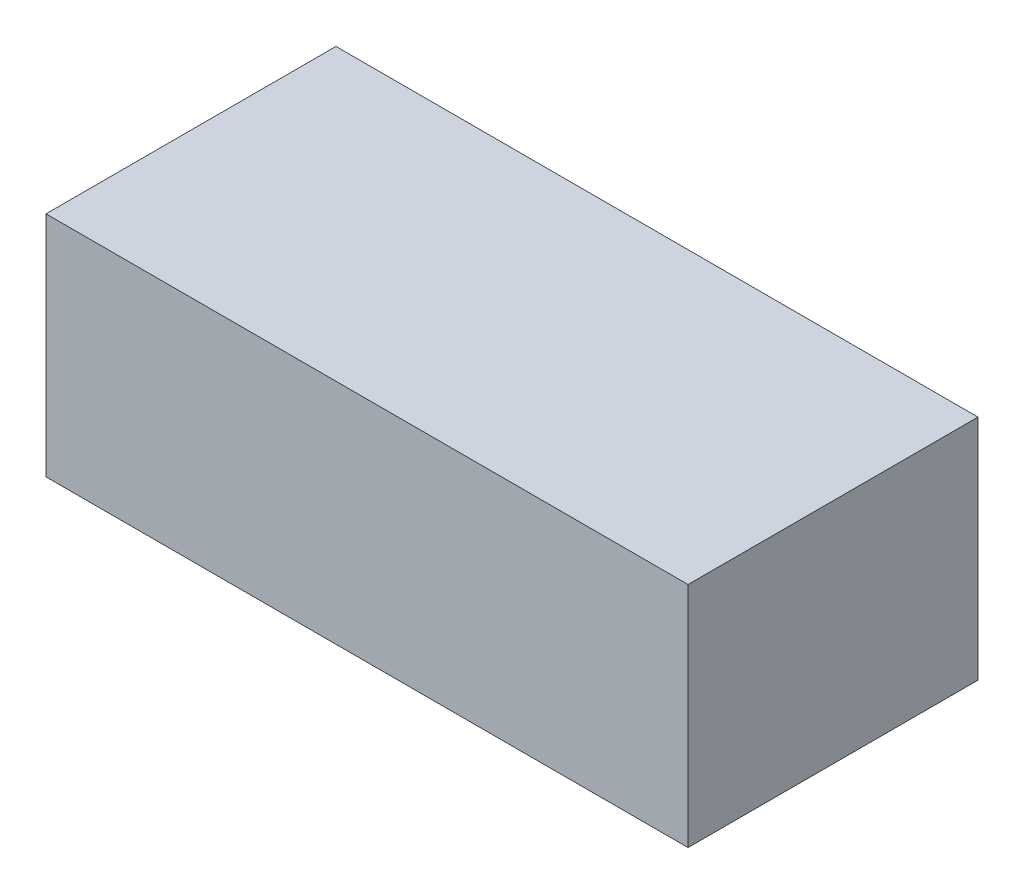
from build123d import *

# Parameters (mm, degrees)
SKETCH1_W           = 31
SKETCH1_H           = 14
BOSS_EXTRUDE1_DEPTH = 11


with BuildPart() as part:
    # Sketch1 → Boss-Extrude1 (new body)
    with BuildSketch(Plane(origin=(0, 0, 0), x_dir=(1, 0, 0), z_dir=(0, 1, 0))):
        Rectangle(SKETCH1_W, SKETCH1_H)
    extrude(amount=BOSS_EXTRUDE1_DEPTH)


solid = part.part
